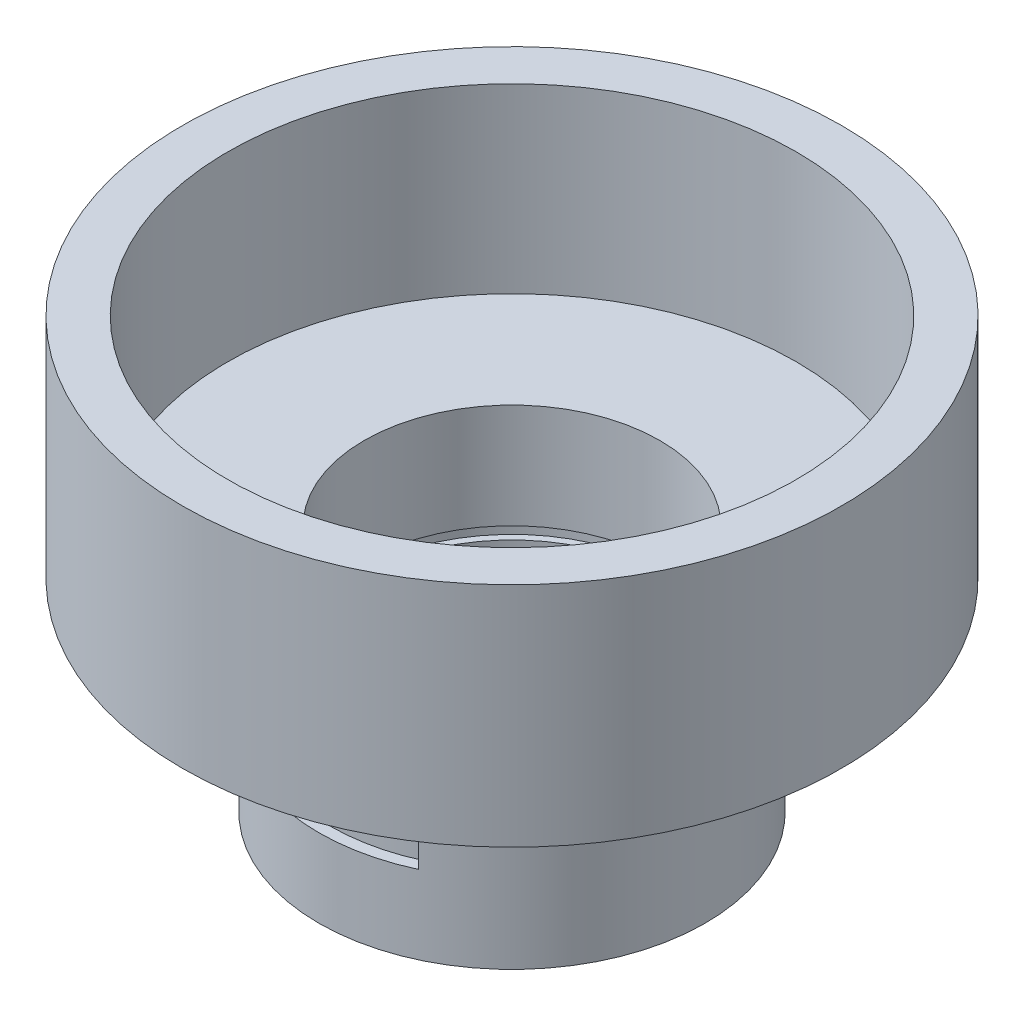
ISO-10303-21;
HEADER;
FILE_DESCRIPTION(('STEP AP214'),'2;1');
FILE_NAME('part.step','',(''),(''),'','','');
FILE_SCHEMA(('AUTOMOTIVE_DESIGN { 1 0 10303 214 1 1 1 1 }'));
ENDSEC;
DATA;
#1=APPLICATION_CONTEXT('core data for automotive mechanical design processes');
#2=APPLICATION_PROTOCOL_DEFINITION('international standard','automotive_design',2000,#1);
#3=PRODUCT_CONTEXT('',#1,'mechanical');
#4=PRODUCT('Part','Part','',(#3));
#5=PRODUCT_RELATED_PRODUCT_CATEGORY('part','',(#4));
#6=PRODUCT_DEFINITION_FORMATION('','',#4);
#7=PRODUCT_DEFINITION_CONTEXT('part definition',#1,'design');
#8=PRODUCT_DEFINITION('design','',#6,#7);
#9=PRODUCT_DEFINITION_SHAPE('','',#8);
#10=(LENGTH_UNIT() NAMED_UNIT(*) SI_UNIT(.MILLI.,.METRE.));
#11=(NAMED_UNIT(*) PLANE_ANGLE_UNIT() SI_UNIT($,.RADIAN.));
#12=(NAMED_UNIT(*) SI_UNIT($,.STERADIAN.) SOLID_ANGLE_UNIT());
#13=UNCERTAINTY_MEASURE_WITH_UNIT(LENGTH_MEASURE(1.E-05),#10,'distance_accuracy_value','');
#14=(GEOMETRIC_REPRESENTATION_CONTEXT(3) GLOBAL_UNCERTAINTY_ASSIGNED_CONTEXT((#13)) GLOBAL_UNIT_ASSIGNED_CONTEXT((#10,
#11,#12)) REPRESENTATION_CONTEXT('',''));
#15=CARTESIAN_POINT('',(0.,0.,0.));
#16=DIRECTION('',(0.,0.,1.));
#17=DIRECTION('',(1.,0.,0.));
#18=AXIS2_PLACEMENT_3D('',#15,#16,#17);
#19=CARTESIAN_POINT('',(62.5,75.1826826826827,0.));
#20=DIRECTION('',(0.,1.,0.));
#21=DIRECTION('',(0.,0.,1.));
#22=AXIS2_PLACEMENT_3D('',#19,#20,#21);
#23=PLANE('',#22);
#24=CARTESIAN_POINT('',(0.,75.1826826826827,0.));
#25=DIRECTION('',(0.,-1.,0.));
#26=DIRECTION('',(0.,0.,-1.));
#27=AXIS2_PLACEMENT_3D('',#24,#25,#26);
#28=CIRCLE('',#27,62.5);
#29=CARTESIAN_POINT('',(0.,75.1826826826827,-62.5));
#30=VERTEX_POINT('',#29);
#31=EDGE_CURVE('E140',#30,#30,#28,.T.);
#32=ORIENTED_EDGE('',*,*,#31,.T.);
#33=EDGE_LOOP('',(#32));
#34=FACE_BOUND('',#33,.T.);
#35=CARTESIAN_POINT('',(0.,75.1826826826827,0.));
#36=DIRECTION('',(0.,-1.,0.));
#37=DIRECTION('',(0.,0.,-1.));
#38=AXIS2_PLACEMENT_3D('',#35,#36,#37);
#39=CIRCLE('',#38,72.5);
#40=CARTESIAN_POINT('',(0.,75.1826826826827,-72.5));
#41=VERTEX_POINT('',#40);
#42=EDGE_CURVE('E38',#41,#41,#39,.T.);
#43=ORIENTED_EDGE('',*,*,#42,.F.);
#44=EDGE_LOOP('',(#43));
#45=FACE_BOUND('',#44,.T.);
#46=ADVANCED_FACE('F31',(#34,#45),#23,.T.);
#47=CARTESIAN_POINT('',(0.,-55.,0.));
#48=DIRECTION('',(0.,-1.,0.));
#49=DIRECTION('',(0.,0.,-1.));
#50=AXIS2_PLACEMENT_3D('',#47,#48,#49);
#51=CYLINDRICAL_SURFACE('',#50,72.5);
#52=ORIENTED_EDGE('',*,*,#42,.T.);
#53=EDGE_LOOP('',(#52));
#54=FACE_BOUND('',#53,.T.);
#55=CARTESIAN_POINT('',(0.,25.1826826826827,0.));
#56=DIRECTION('',(0.,-1.,0.));
#57=DIRECTION('',(0.,0.,-1.));
#58=AXIS2_PLACEMENT_3D('',#55,#56,#57);
#59=CIRCLE('',#58,72.5);
#60=CARTESIAN_POINT('',(0.,25.1826826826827,-72.5));
#61=VERTEX_POINT('',#60);
#62=EDGE_CURVE('E170',#61,#61,#59,.T.);
#63=ORIENTED_EDGE('',*,*,#62,.F.);
#64=EDGE_LOOP('',(#63));
#65=FACE_BOUND('',#64,.T.);
#66=ADVANCED_FACE('F175',(#54,#65),#51,.T.);
#67=CARTESIAN_POINT('',(72.5,25.1826826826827,0.));
#68=DIRECTION('',(0.,-1.,0.));
#69=DIRECTION('',(0.,0.,-1.));
#70=AXIS2_PLACEMENT_3D('',#67,#68,#69);
#71=PLANE('',#70);
#72=CARTESIAN_POINT('',(0.,25.1826826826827,0.));
#73=DIRECTION('',(0.,-1.,0.));
#74=DIRECTION('',(0.,0.,-1.));
#75=AXIS2_PLACEMENT_3D('',#72,#73,#74);
#76=CIRCLE('',#75,42.5);
#77=CARTESIAN_POINT('',(5.,25.1826826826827,-42.2048575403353));
#78=VERTEX_POINT('',#77);
#79=CARTESIAN_POINT('',(-5.,25.1826826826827,-42.2048575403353));
#80=VERTEX_POINT('',#79);
#81=EDGE_CURVE('E167',#78,#80,#76,.T.);
#82=ORIENTED_EDGE('',*,*,#81,.F.);
#83=DIRECTION('',(0.,0.,-1.));
#84=VECTOR('',#83,1.);
#85=CARTESIAN_POINT('',(5.,25.1826826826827,-42.5));
#86=LINE('',#85,#84);
#87=CARTESIAN_POINT('',(5.,25.1826826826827,-37.5));
#88=VERTEX_POINT('',#87);
#89=EDGE_CURVE('E124',#88,#78,#86,.T.);
#90=ORIENTED_EDGE('',*,*,#89,.F.);
#91=DIRECTION('',(1.,0.,0.));
#92=VECTOR('',#91,1.);
#93=CARTESIAN_POINT('',(-5.,25.1826826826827,-37.5));
#94=LINE('',#93,#92);
#95=CARTESIAN_POINT('',(-5.,25.1826826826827,-37.5));
#96=VERTEX_POINT('',#95);
#97=EDGE_CURVE('E126',#96,#88,#94,.T.);
#98=ORIENTED_EDGE('',*,*,#97,.F.);
#99=DIRECTION('',(0.,0.,1.));
#100=VECTOR('',#99,1.);
#101=CARTESIAN_POINT('',(-5.,25.1826826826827,-42.5));
#102=LINE('',#101,#100);
#103=EDGE_CURVE('E129',#80,#96,#102,.T.);
#104=ORIENTED_EDGE('',*,*,#103,.F.);
#105=EDGE_LOOP('',(#82,#90,#98,#104));
#106=FACE_BOUND('',#105,.T.);
#107=ORIENTED_EDGE('',*,*,#62,.T.);
#108=EDGE_LOOP('',(#107));
#109=FACE_BOUND('',#108,.T.);
#110=ADVANCED_FACE('F183',(#106,#109),#71,.T.);
#111=CARTESIAN_POINT('',(0.,-55.,0.));
#112=DIRECTION('',(0.,-1.,0.));
#113=DIRECTION('',(0.,0.,-1.));
#114=AXIS2_PLACEMENT_3D('',#111,#112,#113);
#115=CYLINDRICAL_SURFACE('',#114,42.5);
#116=CARTESIAN_POINT('',(0.,-2.0673173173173,0.));
#117=DIRECTION('',(0.,-1.,0.));
#118=DIRECTION('',(0.,0.,-1.));
#119=AXIS2_PLACEMENT_3D('',#116,#117,#118);
#120=CIRCLE('',#119,42.5);
#121=CARTESIAN_POINT('',(17.9612761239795,-2.0673173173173,38.5180809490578));
#122=VERTEX_POINT('',#121);
#123=CARTESIAN_POINT('',(-17.9612761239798,-2.0673173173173,38.5180809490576));
#124=VERTEX_POINT('',#123);
#125=EDGE_CURVE('E115',#122,#124,#120,.T.);
#126=ORIENTED_EDGE('',*,*,#125,.T.);
#127=DIRECTION('',(0.,1.,0.));
#128=VECTOR('',#127,1.);
#129=CARTESIAN_POINT('',(-17.9612761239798,-2.0673173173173,38.5180809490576));
#130=LINE('',#129,#128);
#131=CARTESIAN_POINT('',(-17.9612761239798,7.9326826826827,38.5180809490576));
#132=VERTEX_POINT('',#131);
#133=EDGE_CURVE('E99',#124,#132,#130,.T.);
#134=ORIENTED_EDGE('',*,*,#133,.T.);
#135=CARTESIAN_POINT('',(0.,7.9326826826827,0.));
#136=DIRECTION('',(0.,-1.,0.));
#137=DIRECTION('',(0.,0.,-1.));
#138=AXIS2_PLACEMENT_3D('',#135,#136,#137);
#139=CIRCLE('',#138,42.5);
#140=CARTESIAN_POINT('',(17.9612761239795,7.9326826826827,38.5180809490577));
#141=VERTEX_POINT('',#140);
#142=EDGE_CURVE('E105',#141,#132,#139,.T.);
#143=ORIENTED_EDGE('',*,*,#142,.F.);
#144=DIRECTION('',(0.,1.,0.));
#145=VECTOR('',#144,1.);
#146=CARTESIAN_POINT('',(17.9612761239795,-2.0673173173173,38.5180809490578));
#147=LINE('',#146,#145);
#148=EDGE_CURVE('E389',#122,#141,#147,.T.);
#149=ORIENTED_EDGE('',*,*,#148,.F.);
#150=EDGE_LOOP('',(#126,#134,#143,#149));
#151=FACE_BOUND('',#150,.T.);
#152=DIRECTION('',(0.,-1.,0.));
#153=VECTOR('',#152,1.);
#154=CARTESIAN_POINT('',(-5.,-55.,-42.2048575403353));
#155=LINE('',#154,#153);
#156=CARTESIAN_POINT('',(-5.,-19.3173173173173,-42.2048575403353));
#157=VERTEX_POINT('',#156);
#158=EDGE_CURVE('E138',#157,#80,#155,.F.);
#159=ORIENTED_EDGE('',*,*,#158,.F.);
#160=CARTESIAN_POINT('',(0.,-19.3173173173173,0.));
#161=DIRECTION('',(0.,-1.,0.));
#162=DIRECTION('',(0.,0.,-1.));
#163=AXIS2_PLACEMENT_3D('',#160,#161,#162);
#164=CIRCLE('',#163,42.5);
#165=CARTESIAN_POINT('',(5.,-19.3173173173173,-42.2048575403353));
#166=VERTEX_POINT('',#165);
#167=EDGE_CURVE('E164',#166,#157,#164,.T.);
#168=ORIENTED_EDGE('',*,*,#167,.F.);
#169=DIRECTION('',(0.,-1.,0.));
#170=VECTOR('',#169,1.);
#171=CARTESIAN_POINT('',(5.,-55.,-42.2048575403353));
#172=LINE('',#171,#170);
#173=EDGE_CURVE('E52',#78,#166,#172,.T.);
#174=ORIENTED_EDGE('',*,*,#173,.F.);
#175=ORIENTED_EDGE('',*,*,#81,.T.);
#176=EDGE_LOOP('',(#159,#168,#174,#175));
#177=FACE_BOUND('',#176,.T.);
#178=ADVANCED_FACE('F112',(#151,#177),#115,.T.);
#179=CARTESIAN_POINT('',(32.5,-19.3173173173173,0.));
#180=DIRECTION('',(0.,-1.,0.));
#181=DIRECTION('',(0.,0.,-1.));
#182=AXIS2_PLACEMENT_3D('',#179,#180,#181);
#183=PLANE('',#182);
#184=DIRECTION('',(0.,0.,-1.));
#185=VECTOR('',#184,1.);
#186=CARTESIAN_POINT('',(-5.,-19.3173173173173,-42.5));
#187=LINE('',#186,#185);
#188=CARTESIAN_POINT('',(-5.,-19.3173173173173,-37.5));
#189=VERTEX_POINT('',#188);
#190=EDGE_CURVE('E116',#189,#157,#187,.T.);
#191=ORIENTED_EDGE('',*,*,#190,.F.);
#192=DIRECTION('',(-1.,0.,0.));
#193=VECTOR('',#192,1.);
#194=CARTESIAN_POINT('',(-5.,-19.3173173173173,-37.5));
#195=LINE('',#194,#193);
#196=CARTESIAN_POINT('',(5.,-19.3173173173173,-37.5));
#197=VERTEX_POINT('',#196);
#198=EDGE_CURVE('E118',#197,#189,#195,.T.);
#199=ORIENTED_EDGE('',*,*,#198,.F.);
#200=DIRECTION('',(0.,0.,1.));
#201=VECTOR('',#200,1.);
#202=CARTESIAN_POINT('',(5.,-19.3173173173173,0.));
#203=LINE('',#202,#201);
#204=EDGE_CURVE('E11',#166,#197,#203,.T.);
#205=ORIENTED_EDGE('',*,*,#204,.F.);
#206=ORIENTED_EDGE('',*,*,#167,.T.);
#207=EDGE_LOOP('',(#191,#199,#205,#206));
#208=FACE_BOUND('',#207,.T.);
#209=CARTESIAN_POINT('',(0.,-19.3173173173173,0.));
#210=DIRECTION('',(0.,-1.,0.));
#211=DIRECTION('',(0.,0.,-1.));
#212=AXIS2_PLACEMENT_3D('',#209,#210,#211);
#213=CIRCLE('',#212,32.5);
#214=CARTESIAN_POINT('',(0.,-19.3173173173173,-32.5));
#215=VERTEX_POINT('',#214);
#216=EDGE_CURVE('E161',#215,#215,#213,.T.);
#217=ORIENTED_EDGE('',*,*,#216,.F.);
#218=EDGE_LOOP('',(#217));
#219=FACE_BOUND('',#218,.T.);
#220=ADVANCED_FACE('F222',(#208,#219),#183,.T.);
#221=CARTESIAN_POINT('',(0.,-55.,0.));
#222=DIRECTION('',(0.,-1.,0.));
#223=DIRECTION('',(0.,0.,-1.));
#224=AXIS2_PLACEMENT_3D('',#221,#222,#223);
#225=CYLINDRICAL_SURFACE('',#224,32.5);
#226=ORIENTED_EDGE('',*,*,#216,.T.);
#227=EDGE_LOOP('',(#226));
#228=FACE_BOUND('',#227,.T.);
#229=CARTESIAN_POINT('',(0.,9.48268268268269,0.));
#230=DIRECTION('',(0.,-1.,0.));
#231=DIRECTION('',(0.,0.,-1.));
#232=AXIS2_PLACEMENT_3D('',#229,#230,#231);
#233=CIRCLE('',#232,32.5);
#234=CARTESIAN_POINT('',(0.,9.48268268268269,-32.5));
#235=VERTEX_POINT('',#234);
#236=EDGE_CURVE('E158',#235,#235,#233,.T.);
#237=ORIENTED_EDGE('',*,*,#236,.F.);
#238=EDGE_LOOP('',(#237));
#239=FACE_BOUND('',#238,.T.);
#240=ADVANCED_FACE('F218',(#228,#239),#225,.F.);
#241=CARTESIAN_POINT('',(34.,9.48268268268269,0.));
#242=DIRECTION('',(0.,1.,0.));
#243=DIRECTION('',(0.,0.,1.));
#244=AXIS2_PLACEMENT_3D('',#241,#242,#243);
#245=PLANE('',#244);
#246=ORIENTED_EDGE('',*,*,#236,.T.);
#247=EDGE_LOOP('',(#246));
#248=FACE_BOUND('',#247,.T.);
#249=CARTESIAN_POINT('',(0.,9.48268268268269,0.));
#250=DIRECTION('',(0.,-1.,0.));
#251=DIRECTION('',(0.,0.,-1.));
#252=AXIS2_PLACEMENT_3D('',#249,#250,#251);
#253=CIRCLE('',#252,34.);
#254=CARTESIAN_POINT('',(0.,9.48268268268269,-34.));
#255=VERTEX_POINT('',#254);
#256=EDGE_CURVE('E155',#255,#255,#253,.T.);
#257=ORIENTED_EDGE('',*,*,#256,.F.);
#258=EDGE_LOOP('',(#257));
#259=FACE_BOUND('',#258,.T.);
#260=ADVANCED_FACE('F214',(#248,#259),#245,.T.);
#261=CARTESIAN_POINT('',(0.,-55.,0.));
#262=DIRECTION('',(0.,-1.,0.));
#263=DIRECTION('',(0.,0.,-1.));
#264=AXIS2_PLACEMENT_3D('',#261,#262,#263);
#265=CYLINDRICAL_SURFACE('',#264,34.);
#266=ORIENTED_EDGE('',*,*,#256,.T.);
#267=EDGE_LOOP('',(#266));
#268=FACE_BOUND('',#267,.T.);
#269=CARTESIAN_POINT('',(0.,12.1826826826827,0.));
#270=DIRECTION('',(0.,-1.,0.));
#271=DIRECTION('',(0.,0.,-1.));
#272=AXIS2_PLACEMENT_3D('',#269,#270,#271);
#273=CIRCLE('',#272,34.);
#274=CARTESIAN_POINT('',(0.,12.1826826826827,-34.));
#275=VERTEX_POINT('',#274);
#276=EDGE_CURVE('E152',#275,#275,#273,.T.);
#277=ORIENTED_EDGE('',*,*,#276,.F.);
#278=EDGE_LOOP('',(#277));
#279=FACE_BOUND('',#278,.T.);
#280=ADVANCED_FACE('F210',(#268,#279),#265,.F.);
#281=CARTESIAN_POINT('',(32.5,12.1826826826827,0.));
#282=DIRECTION('',(0.,-1.,0.));
#283=DIRECTION('',(0.,0.,-1.));
#284=AXIS2_PLACEMENT_3D('',#281,#282,#283);
#285=PLANE('',#284);
#286=ORIENTED_EDGE('',*,*,#276,.T.);
#287=EDGE_LOOP('',(#286));
#288=FACE_BOUND('',#287,.T.);
#289=CARTESIAN_POINT('',(0.,12.1826826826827,0.));
#290=DIRECTION('',(0.,-1.,0.));
#291=DIRECTION('',(0.,0.,-1.));
#292=AXIS2_PLACEMENT_3D('',#289,#290,#291);
#293=CIRCLE('',#292,32.5);
#294=CARTESIAN_POINT('',(0.,12.1826826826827,-32.5));
#295=VERTEX_POINT('',#294);
#296=EDGE_CURVE('E149',#295,#295,#293,.T.);
#297=ORIENTED_EDGE('',*,*,#296,.F.);
#298=EDGE_LOOP('',(#297));
#299=FACE_BOUND('',#298,.T.);
#300=ADVANCED_FACE('F206',(#288,#299),#285,.T.);
#301=CARTESIAN_POINT('',(0.,-55.,0.));
#302=DIRECTION('',(0.,-1.,0.));
#303=DIRECTION('',(0.,0.,-1.));
#304=AXIS2_PLACEMENT_3D('',#301,#302,#303);
#305=CYLINDRICAL_SURFACE('',#304,32.5);
#306=ORIENTED_EDGE('',*,*,#296,.T.);
#307=EDGE_LOOP('',(#306));
#308=FACE_BOUND('',#307,.T.);
#309=CARTESIAN_POINT('',(0.,35.1826826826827,0.));
#310=DIRECTION('',(0.,-1.,0.));
#311=DIRECTION('',(0.,0.,-1.));
#312=AXIS2_PLACEMENT_3D('',#309,#310,#311);
#313=CIRCLE('',#312,32.5);
#314=CARTESIAN_POINT('',(0.,35.1826826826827,-32.5));
#315=VERTEX_POINT('',#314);
#316=EDGE_CURVE('E146',#315,#315,#313,.T.);
#317=ORIENTED_EDGE('',*,*,#316,.F.);
#318=EDGE_LOOP('',(#317));
#319=FACE_BOUND('',#318,.T.);
#320=ADVANCED_FACE('F199',(#308,#319),#305,.F.);
#321=CARTESIAN_POINT('',(62.5,35.1826826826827,0.));
#322=DIRECTION('',(0.,1.,0.));
#323=DIRECTION('',(0.,0.,1.));
#324=AXIS2_PLACEMENT_3D('',#321,#322,#323);
#325=PLANE('',#324);
#326=ORIENTED_EDGE('',*,*,#316,.T.);
#327=EDGE_LOOP('',(#326));
#328=FACE_BOUND('',#327,.T.);
#329=CARTESIAN_POINT('',(0.,35.1826826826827,0.));
#330=DIRECTION('',(0.,-1.,0.));
#331=DIRECTION('',(0.,0.,-1.));
#332=AXIS2_PLACEMENT_3D('',#329,#330,#331);
#333=CIRCLE('',#332,62.5);
#334=CARTESIAN_POINT('',(0.,35.1826826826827,-62.5));
#335=VERTEX_POINT('',#334);
#336=EDGE_CURVE('E143',#335,#335,#333,.T.);
#337=ORIENTED_EDGE('',*,*,#336,.F.);
#338=EDGE_LOOP('',(#337));
#339=FACE_BOUND('',#338,.T.);
#340=ADVANCED_FACE('F189',(#328,#339),#325,.T.);
#341=CARTESIAN_POINT('',(0.,-55.,0.));
#342=DIRECTION('',(0.,-1.,0.));
#343=DIRECTION('',(0.,0.,-1.));
#344=AXIS2_PLACEMENT_3D('',#341,#342,#343);
#345=CYLINDRICAL_SURFACE('',#344,62.5);
#346=ORIENTED_EDGE('',*,*,#336,.T.);
#347=EDGE_LOOP('',(#346));
#348=FACE_BOUND('',#347,.T.);
#349=ORIENTED_EDGE('',*,*,#31,.F.);
#350=EDGE_LOOP('',(#349));
#351=FACE_BOUND('',#350,.T.);
#352=ADVANCED_FACE('F186',(#348,#351),#345,.F.);
#353=CARTESIAN_POINT('',(-5.,36.3630225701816,-42.5));
#354=DIRECTION('',(-1.,0.,0.));
#355=DIRECTION('',(0.,0.,1.));
#356=AXIS2_PLACEMENT_3D('',#353,#354,#355);
#357=PLANE('',#356);
#358=ORIENTED_EDGE('',*,*,#158,.T.);
#359=ORIENTED_EDGE('',*,*,#103,.T.);
#360=DIRECTION('',(0.,-1.,0.));
#361=VECTOR('',#360,1.);
#362=CARTESIAN_POINT('',(-5.,36.3630225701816,-37.5));
#363=LINE('',#362,#361);
#364=EDGE_CURVE('E127',#96,#189,#363,.T.);
#365=ORIENTED_EDGE('',*,*,#364,.T.);
#366=ORIENTED_EDGE('',*,*,#190,.T.);
#367=EDGE_LOOP('',(#358,#359,#365,#366));
#368=FACE_BOUND('',#367,.T.);
#369=ADVANCED_FACE('F188',(#368),#357,.F.);
#370=CARTESIAN_POINT('',(-5.,36.3630225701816,-37.5));
#371=DIRECTION('',(0.,0.,1.));
#372=DIRECTION('',(1.,0.,0.));
#373=AXIS2_PLACEMENT_3D('',#370,#371,#372);
#374=PLANE('',#373);
#375=ORIENTED_EDGE('',*,*,#97,.T.);
#376=DIRECTION('',(0.,-1.,0.));
#377=VECTOR('',#376,1.);
#378=CARTESIAN_POINT('',(5.,36.3630225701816,-37.5));
#379=LINE('',#378,#377);
#380=EDGE_CURVE('E133',#88,#197,#379,.T.);
#381=ORIENTED_EDGE('',*,*,#380,.T.);
#382=ORIENTED_EDGE('',*,*,#198,.T.);
#383=ORIENTED_EDGE('',*,*,#364,.F.);
#384=EDGE_LOOP('',(#375,#381,#382,#383));
#385=FACE_BOUND('',#384,.T.);
#386=ADVANCED_FACE('F196',(#385),#374,.F.);
#387=CARTESIAN_POINT('',(5.,36.3630225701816,-42.5));
#388=DIRECTION('',(1.,0.,0.));
#389=DIRECTION('',(0.,0.,-1.));
#390=AXIS2_PLACEMENT_3D('',#387,#388,#389);
#391=PLANE('',#390);
#392=ORIENTED_EDGE('',*,*,#173,.T.);
#393=ORIENTED_EDGE('',*,*,#204,.T.);
#394=ORIENTED_EDGE('',*,*,#380,.F.);
#395=ORIENTED_EDGE('',*,*,#89,.T.);
#396=EDGE_LOOP('',(#392,#393,#394,#395));
#397=FACE_BOUND('',#396,.T.);
#398=ADVANCED_FACE('F245',(#397),#391,.F.);
#399=CARTESIAN_POINT('',(-17.9612761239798,-2.0673173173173,38.5180809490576));
#400=DIRECTION('',(0.90630778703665,0.,0.422618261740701));
#401=DIRECTION('',(0.422618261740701,0.,-0.90630778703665));
#402=AXIS2_PLACEMENT_3D('',#399,#400,#401);
#403=PLANE('',#402);
#404=ORIENTED_EDGE('',*,*,#133,.F.);
#405=DIRECTION('',(0.422618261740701,0.,-0.90630778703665));
#406=VECTOR('',#405,1.);
#407=CARTESIAN_POINT('',(-17.9612761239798,-2.0673173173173,38.5180809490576));
#408=LINE('',#407,#406);
#409=CARTESIAN_POINT('',(-16.904730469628,-2.0673173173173,36.252311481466));
#410=VERTEX_POINT('',#409);
#411=EDGE_CURVE('E387',#124,#410,#408,.T.);
#412=ORIENTED_EDGE('',*,*,#411,.T.);
#413=DIRECTION('',(0.,1.,0.));
#414=VECTOR('',#413,1.);
#415=CARTESIAN_POINT('',(-16.904730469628,-2.0673173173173,36.252311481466));
#416=LINE('',#415,#414);
#417=CARTESIAN_POINT('',(-16.904730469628,7.9326826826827,36.252311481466));
#418=VERTEX_POINT('',#417);
#419=EDGE_CURVE('E102',#410,#418,#416,.T.);
#420=ORIENTED_EDGE('',*,*,#419,.T.);
#421=DIRECTION('',(0.422618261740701,0.,-0.90630778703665));
#422=VECTOR('',#421,1.);
#423=CARTESIAN_POINT('',(-17.9612761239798,7.9326826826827,38.5180809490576));
#424=LINE('',#423,#422);
#425=EDGE_CURVE('E96',#132,#418,#424,.T.);
#426=ORIENTED_EDGE('',*,*,#425,.F.);
#427=EDGE_LOOP('',(#404,#412,#420,#426));
#428=FACE_BOUND('',#427,.T.);
#429=ADVANCED_FACE('F97',(#428),#403,.T.);
#430=CARTESIAN_POINT('',(0.,-2.0673173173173,0.));
#431=DIRECTION('',(0.,1.,0.));
#432=DIRECTION('',(0.,0.,1.));
#433=AXIS2_PLACEMENT_3D('',#430,#431,#432);
#434=CYLINDRICAL_SURFACE('',#433,40.);
#435=ORIENTED_EDGE('',*,*,#419,.F.);
#436=CARTESIAN_POINT('',(0.,-2.0673173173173,0.));
#437=DIRECTION('',(0.,1.,0.));
#438=DIRECTION('',(0.,0.,-1.));
#439=AXIS2_PLACEMENT_3D('',#436,#437,#438);
#440=CIRCLE('',#439,40.);
#441=CARTESIAN_POINT('',(16.9047304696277,-2.0673173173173,36.2523114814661));
#442=VERTEX_POINT('',#441);
#443=EDGE_CURVE('E391',#410,#442,#440,.T.);
#444=ORIENTED_EDGE('',*,*,#443,.T.);
#445=DIRECTION('',(0.,1.,0.));
#446=VECTOR('',#445,1.);
#447=CARTESIAN_POINT('',(16.9047304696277,-2.0673173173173,36.2523114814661));
#448=LINE('',#447,#446);
#449=CARTESIAN_POINT('',(16.9047304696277,7.9326826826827,36.2523114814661));
#450=VERTEX_POINT('',#449);
#451=EDGE_CURVE('E120',#442,#450,#448,.T.);
#452=ORIENTED_EDGE('',*,*,#451,.T.);
#453=CARTESIAN_POINT('',(0.,7.9326826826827,0.));
#454=DIRECTION('',(0.,1.,0.));
#455=DIRECTION('',(0.,0.,-1.));
#456=AXIS2_PLACEMENT_3D('',#453,#454,#455);
#457=CIRCLE('',#456,40.);
#458=EDGE_CURVE('E104',#418,#450,#457,.T.);
#459=ORIENTED_EDGE('',*,*,#458,.F.);
#460=EDGE_LOOP('',(#435,#444,#452,#459));
#461=FACE_BOUND('',#460,.T.);
#462=ADVANCED_FACE('F256',(#461),#434,.T.);
#463=CARTESIAN_POINT('',(16.9047304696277,-2.0673173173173,36.2523114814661));
#464=DIRECTION('',(-0.906307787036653,0.,0.422618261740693));
#465=DIRECTION('',(0.422618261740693,0.,0.906307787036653));
#466=AXIS2_PLACEMENT_3D('',#463,#464,#465);
#467=PLANE('',#466);
#468=ORIENTED_EDGE('',*,*,#451,.F.);
#469=DIRECTION('',(0.422618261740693,0.,0.906307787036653));
#470=VECTOR('',#469,1.);
#471=CARTESIAN_POINT('',(16.9047304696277,-2.0673173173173,36.2523114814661));
#472=LINE('',#471,#470);
#473=EDGE_CURVE('E386',#442,#122,#472,.T.);
#474=ORIENTED_EDGE('',*,*,#473,.T.);
#475=ORIENTED_EDGE('',*,*,#148,.T.);
#476=DIRECTION('',(0.422618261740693,0.,0.906307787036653));
#477=VECTOR('',#476,1.);
#478=CARTESIAN_POINT('',(16.9047304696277,7.9326826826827,36.2523114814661));
#479=LINE('',#478,#477);
#480=EDGE_CURVE('E45',#450,#141,#479,.T.);
#481=ORIENTED_EDGE('',*,*,#480,.F.);
#482=EDGE_LOOP('',(#468,#474,#475,#481));
#483=FACE_BOUND('',#482,.T.);
#484=ADVANCED_FACE('F259',(#483),#467,.T.);
#485=CARTESIAN_POINT('',(0.,-2.0673173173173,0.));
#486=DIRECTION('',(0.,-1.,0.));
#487=DIRECTION('',(0.,0.,-1.));
#488=AXIS2_PLACEMENT_3D('',#485,#486,#487);
#489=PLANE('',#488);
#490=ORIENTED_EDGE('',*,*,#125,.F.);
#491=ORIENTED_EDGE('',*,*,#473,.F.);
#492=ORIENTED_EDGE('',*,*,#443,.F.);
#493=ORIENTED_EDGE('',*,*,#411,.F.);
#494=EDGE_LOOP('',(#490,#491,#492,#493));
#495=FACE_BOUND('',#494,.T.);
#496=ADVANCED_FACE('F263',(#495),#489,.F.);
#497=CARTESIAN_POINT('',(0.,7.9326826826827,0.));
#498=DIRECTION('',(0.,-1.,0.));
#499=DIRECTION('',(0.,0.,-1.));
#500=AXIS2_PLACEMENT_3D('',#497,#498,#499);
#501=PLANE('',#500);
#502=ORIENTED_EDGE('',*,*,#142,.T.);
#503=ORIENTED_EDGE('',*,*,#425,.T.);
#504=ORIENTED_EDGE('',*,*,#458,.T.);
#505=ORIENTED_EDGE('',*,*,#480,.T.);
#506=EDGE_LOOP('',(#502,#503,#504,#505));
#507=FACE_BOUND('',#506,.T.);
#508=ADVANCED_FACE('F108',(#507),#501,.T.);
#509=CLOSED_SHELL('',(#46,#66,#110,#178,#220,#240,#260,#280,#300,#320,#340,#352,#369,#386,#398,
#429,#462,#484,#496,#508));
#510=MANIFOLD_SOLID_BREP('B2',#509);
#511=ADVANCED_BREP_SHAPE_REPRESENTATION('',(#18,#510),#14);
#512=SHAPE_DEFINITION_REPRESENTATION(#9,#511);
ENDSEC;
END-ISO-10303-21;
